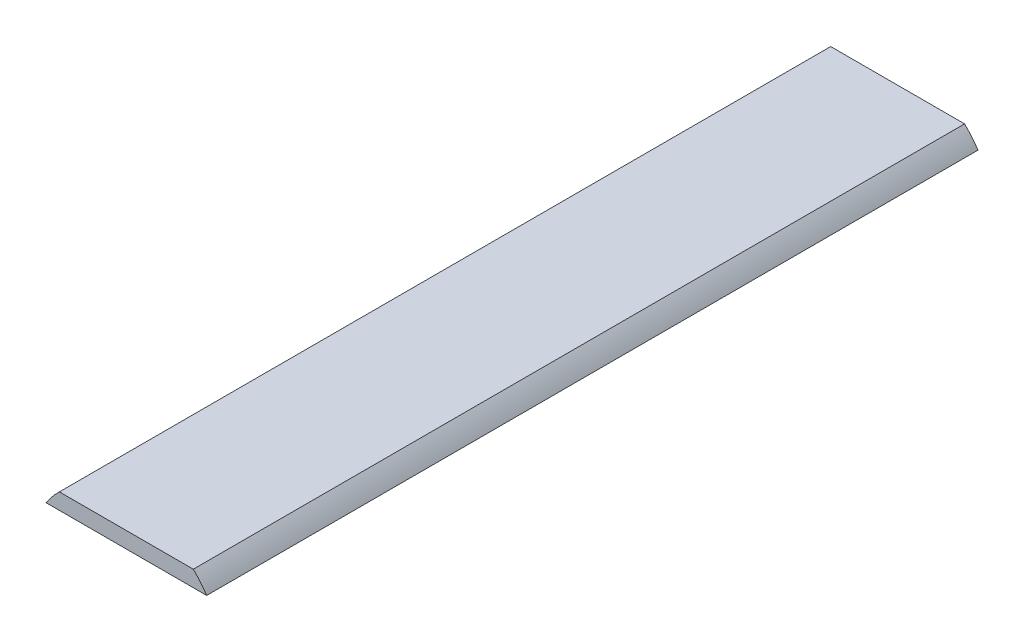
ISO-10303-21;
HEADER;
FILE_DESCRIPTION(('STEP AP214'),'2;1');
FILE_NAME('part.step','',(''),(''),'','','');
FILE_SCHEMA(('AUTOMOTIVE_DESIGN { 1 0 10303 214 1 1 1 1 }'));
ENDSEC;
DATA;
#1=APPLICATION_CONTEXT('core data for automotive mechanical design processes');
#2=APPLICATION_PROTOCOL_DEFINITION('international standard','automotive_design',2000,#1);
#3=PRODUCT_CONTEXT('',#1,'mechanical');
#4=PRODUCT('Part','Part','',(#3));
#5=PRODUCT_RELATED_PRODUCT_CATEGORY('part','',(#4));
#6=PRODUCT_DEFINITION_FORMATION('','',#4);
#7=PRODUCT_DEFINITION_CONTEXT('part definition',#1,'design');
#8=PRODUCT_DEFINITION('design','',#6,#7);
#9=PRODUCT_DEFINITION_SHAPE('','',#8);
#10=(LENGTH_UNIT() NAMED_UNIT(*) SI_UNIT(.MILLI.,.METRE.));
#11=(NAMED_UNIT(*) PLANE_ANGLE_UNIT() SI_UNIT($,.RADIAN.));
#12=(NAMED_UNIT(*) SI_UNIT($,.STERADIAN.) SOLID_ANGLE_UNIT());
#13=UNCERTAINTY_MEASURE_WITH_UNIT(LENGTH_MEASURE(1.E-05),#10,'distance_accuracy_value','');
#14=(GEOMETRIC_REPRESENTATION_CONTEXT(3) GLOBAL_UNCERTAINTY_ASSIGNED_CONTEXT((#13)) GLOBAL_UNIT_ASSIGNED_CONTEXT((#10,
#11,#12)) REPRESENTATION_CONTEXT('',''));
#15=CARTESIAN_POINT('',(0.,0.,0.));
#16=DIRECTION('',(0.,0.,1.));
#17=DIRECTION('',(1.,0.,0.));
#18=AXIS2_PLACEMENT_3D('',#15,#16,#17);
#19=CARTESIAN_POINT('',(0.,0.,152.4));
#20=DIRECTION('',(0.,0.,-1.));
#21=DIRECTION('',(-1.,0.,0.));
#22=AXIS2_PLACEMENT_3D('',#19,#20,#21);
#23=CYLINDRICAL_SURFACE('',#22,19.05);
#24=CARTESIAN_POINT('',(0.,0.,152.4));
#25=DIRECTION('',(0.,0.,1.));
#26=DIRECTION('',(1.,0.,0.));
#27=AXIS2_PLACEMENT_3D('',#24,#25,#26);
#28=CIRCLE('',#27,19.05);
#29=CARTESIAN_POINT('',(15.875,10.5302837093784,152.4));
#30=VERTEX_POINT('',#29);
#31=CARTESIAN_POINT('',(13.2313150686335,13.7052837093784,152.4));
#32=VERTEX_POINT('',#31);
#33=EDGE_CURVE('E39',#30,#32,#28,.T.);
#34=ORIENTED_EDGE('',*,*,#33,.F.);
#35=DIRECTION('',(0.,0.,1.));
#36=VECTOR('',#35,1.);
#37=CARTESIAN_POINT('',(15.875,10.5302837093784,0.));
#38=LINE('',#37,#36);
#39=CARTESIAN_POINT('',(15.875,10.5302837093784,0.));
#40=VERTEX_POINT('',#39);
#41=EDGE_CURVE('E71',#40,#30,#38,.T.);
#42=ORIENTED_EDGE('',*,*,#41,.F.);
#43=CARTESIAN_POINT('',(0.,0.,0.));
#44=DIRECTION('',(0.,0.,1.));
#45=DIRECTION('',(1.,0.,0.));
#46=AXIS2_PLACEMENT_3D('',#43,#44,#45);
#47=CIRCLE('',#46,19.05);
#48=CARTESIAN_POINT('',(13.2313150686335,13.7052837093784,0.));
#49=VERTEX_POINT('',#48);
#50=EDGE_CURVE('E54',#40,#49,#47,.T.);
#51=ORIENTED_EDGE('',*,*,#50,.T.);
#52=DIRECTION('',(0.,0.,1.));
#53=VECTOR('',#52,1.);
#54=CARTESIAN_POINT('',(13.2313150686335,13.7052837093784,0.));
#55=LINE('',#54,#53);
#56=EDGE_CURVE('E84',#49,#32,#55,.T.);
#57=ORIENTED_EDGE('',*,*,#56,.T.);
#58=EDGE_LOOP('',(#34,#42,#51,#57));
#59=FACE_BOUND('',#58,.T.);
#60=ADVANCED_FACE('F31',(#59),#23,.T.);
#61=CARTESIAN_POINT('',(-13.2313150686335,13.7052837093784,0.));
#62=VERTEX_POINT('',#61);
#63=CARTESIAN_POINT('',(-15.875,10.5302837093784,0.));
#64=VERTEX_POINT('',#63);
#65=EDGE_CURVE('E85',#62,#64,#47,.T.);
#66=ORIENTED_EDGE('',*,*,#65,.T.);
#67=DIRECTION('',(0.,0.,1.));
#68=VECTOR('',#67,1.);
#69=CARTESIAN_POINT('',(-15.875,10.5302837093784,0.));
#70=LINE('',#69,#68);
#71=CARTESIAN_POINT('',(-15.875,10.5302837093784,152.4));
#72=VERTEX_POINT('',#71);
#73=EDGE_CURVE('E46',#64,#72,#70,.T.);
#74=ORIENTED_EDGE('',*,*,#73,.T.);
#75=CARTESIAN_POINT('',(-13.2313150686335,13.7052837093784,152.4));
#76=VERTEX_POINT('',#75);
#77=EDGE_CURVE('E11',#76,#72,#28,.T.);
#78=ORIENTED_EDGE('',*,*,#77,.F.);
#79=DIRECTION('',(0.,0.,1.));
#80=VECTOR('',#79,1.);
#81=CARTESIAN_POINT('',(-13.2313150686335,13.7052837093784,0.));
#82=LINE('',#81,#80);
#83=EDGE_CURVE('E91',#62,#76,#82,.T.);
#84=ORIENTED_EDGE('',*,*,#83,.F.);
#85=EDGE_LOOP('',(#66,#74,#78,#84));
#86=FACE_BOUND('',#85,.T.);
#87=ADVANCED_FACE('F33',(#86),#23,.T.);
#88=CARTESIAN_POINT('',(0.,0.,152.4));
#89=DIRECTION('',(0.,0.,1.));
#90=DIRECTION('',(1.,0.,0.));
#91=AXIS2_PLACEMENT_3D('',#88,#89,#90);
#92=PLANE('',#91);
#93=DIRECTION('',(-1.,0.,0.));
#94=VECTOR('',#93,1.);
#95=CARTESIAN_POINT('',(-15.875,10.5302837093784,152.4));
#96=LINE('',#95,#94);
#97=EDGE_CURVE('E74',#30,#72,#96,.T.);
#98=ORIENTED_EDGE('',*,*,#97,.F.);
#99=ORIENTED_EDGE('',*,*,#33,.T.);
#100=DIRECTION('',(1.,0.,0.));
#101=VECTOR('',#100,1.);
#102=CARTESIAN_POINT('',(-13.2313150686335,13.7052837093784,152.4));
#103=LINE('',#102,#101);
#104=EDGE_CURVE('E97',#76,#32,#103,.T.);
#105=ORIENTED_EDGE('',*,*,#104,.F.);
#106=ORIENTED_EDGE('',*,*,#77,.T.);
#107=EDGE_LOOP('',(#98,#99,#105,#106));
#108=FACE_BOUND('',#107,.T.);
#109=ADVANCED_FACE('F79',(#108),#92,.T.);
#110=CARTESIAN_POINT('',(0.,0.,0.));
#111=DIRECTION('',(0.,0.,1.));
#112=DIRECTION('',(1.,0.,0.));
#113=AXIS2_PLACEMENT_3D('',#110,#111,#112);
#114=PLANE('',#113);
#115=ORIENTED_EDGE('',*,*,#50,.F.);
#116=DIRECTION('',(-1.,0.,0.));
#117=VECTOR('',#116,1.);
#118=CARTESIAN_POINT('',(-15.875,10.5302837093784,0.));
#119=LINE('',#118,#117);
#120=EDGE_CURVE('E75',#40,#64,#119,.T.);
#121=ORIENTED_EDGE('',*,*,#120,.T.);
#122=ORIENTED_EDGE('',*,*,#65,.F.);
#123=DIRECTION('',(1.,0.,0.));
#124=VECTOR('',#123,1.);
#125=CARTESIAN_POINT('',(-13.2313150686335,13.7052837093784,0.));
#126=LINE('',#125,#124);
#127=EDGE_CURVE('E93',#62,#49,#126,.T.);
#128=ORIENTED_EDGE('',*,*,#127,.T.);
#129=EDGE_LOOP('',(#115,#121,#122,#128));
#130=FACE_BOUND('',#129,.T.);
#131=ADVANCED_FACE('F101',(#130),#114,.F.);
#132=CARTESIAN_POINT('',(-13.2313150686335,13.7052837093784,0.));
#133=DIRECTION('',(0.,-1.,0.));
#134=DIRECTION('',(0.,0.,-1.));
#135=AXIS2_PLACEMENT_3D('',#132,#133,#134);
#136=PLANE('',#135);
#137=ORIENTED_EDGE('',*,*,#104,.T.);
#138=ORIENTED_EDGE('',*,*,#56,.F.);
#139=ORIENTED_EDGE('',*,*,#127,.F.);
#140=ORIENTED_EDGE('',*,*,#83,.T.);
#141=EDGE_LOOP('',(#137,#138,#139,#140));
#142=FACE_BOUND('',#141,.T.);
#143=ADVANCED_FACE('F103',(#142),#136,.F.);
#144=CARTESIAN_POINT('',(-15.875,10.5302837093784,0.));
#145=DIRECTION('',(0.,1.,0.));
#146=DIRECTION('',(0.,0.,1.));
#147=AXIS2_PLACEMENT_3D('',#144,#145,#146);
#148=PLANE('',#147);
#149=ORIENTED_EDGE('',*,*,#97,.T.);
#150=ORIENTED_EDGE('',*,*,#73,.F.);
#151=ORIENTED_EDGE('',*,*,#120,.F.);
#152=ORIENTED_EDGE('',*,*,#41,.T.);
#153=EDGE_LOOP('',(#149,#150,#151,#152));
#154=FACE_BOUND('',#153,.T.);
#155=ADVANCED_FACE('F73',(#154),#148,.F.);
#156=CLOSED_SHELL('',(#60,#87,#109,#131,#143,#155));
#157=MANIFOLD_SOLID_BREP('B2',#156);
#158=ADVANCED_BREP_SHAPE_REPRESENTATION('',(#18,#157),#14);
#159=SHAPE_DEFINITION_REPRESENTATION(#9,#158);
ENDSEC;
END-ISO-10303-21;
